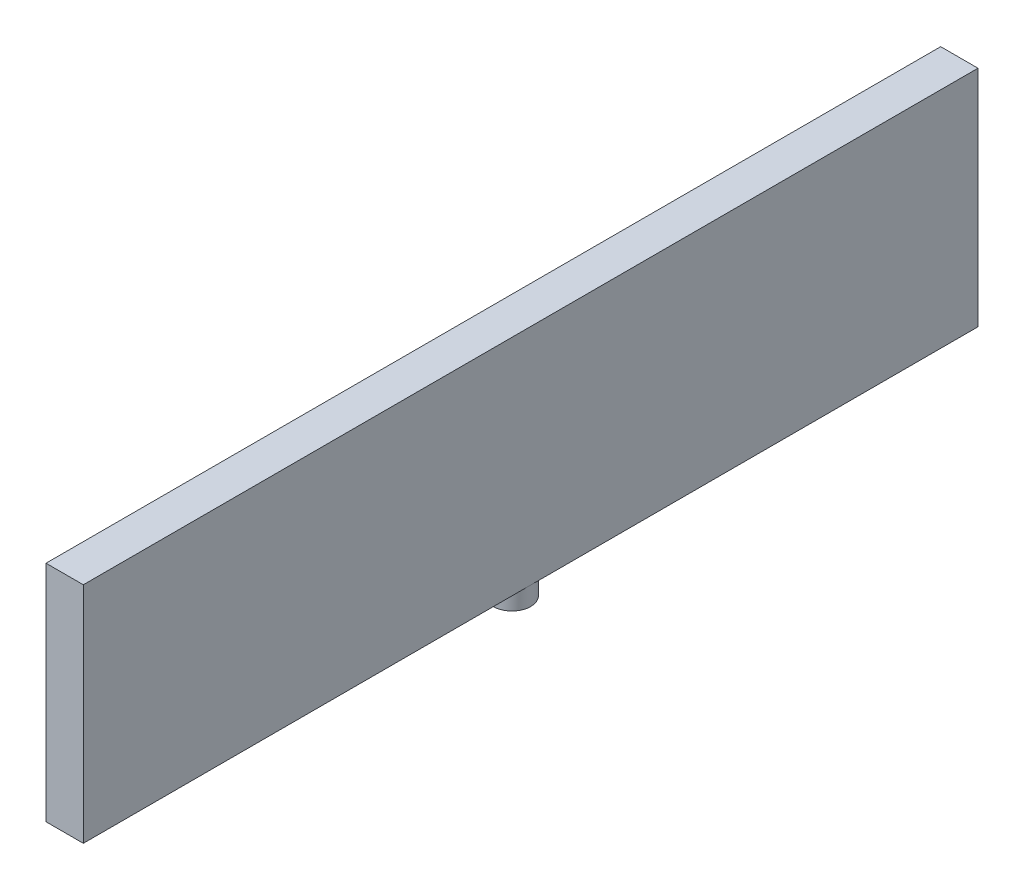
ISO-10303-21;
HEADER;
FILE_DESCRIPTION(('STEP AP214'),'2;1');
FILE_NAME('part.step','',(''),(''),'','','');
FILE_SCHEMA(('AUTOMOTIVE_DESIGN { 1 0 10303 214 1 1 1 1 }'));
ENDSEC;
DATA;
#1=APPLICATION_CONTEXT('core data for automotive mechanical design processes');
#2=APPLICATION_PROTOCOL_DEFINITION('international standard','automotive_design',2000,#1);
#3=PRODUCT_CONTEXT('',#1,'mechanical');
#4=PRODUCT('Part','Part','',(#3));
#5=PRODUCT_RELATED_PRODUCT_CATEGORY('part','',(#4));
#6=PRODUCT_DEFINITION_FORMATION('','',#4);
#7=PRODUCT_DEFINITION_CONTEXT('part definition',#1,'design');
#8=PRODUCT_DEFINITION('design','',#6,#7);
#9=PRODUCT_DEFINITION_SHAPE('','',#8);
#10=(LENGTH_UNIT() NAMED_UNIT(*) SI_UNIT(.MILLI.,.METRE.));
#11=(NAMED_UNIT(*) PLANE_ANGLE_UNIT() SI_UNIT($,.RADIAN.));
#12=(NAMED_UNIT(*) SI_UNIT($,.STERADIAN.) SOLID_ANGLE_UNIT());
#13=UNCERTAINTY_MEASURE_WITH_UNIT(LENGTH_MEASURE(1.E-05),#10,'distance_accuracy_value','');
#14=(GEOMETRIC_REPRESENTATION_CONTEXT(3) GLOBAL_UNCERTAINTY_ASSIGNED_CONTEXT((#13)) GLOBAL_UNIT_ASSIGNED_CONTEXT((#10,
#11,#12)) REPRESENTATION_CONTEXT('',''));
#15=CARTESIAN_POINT('',(0.,0.,0.));
#16=DIRECTION('',(0.,0.,1.));
#17=DIRECTION('',(1.,0.,0.));
#18=AXIS2_PLACEMENT_3D('',#15,#16,#17);
#19=CARTESIAN_POINT('',(-175.332936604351,123.187086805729,-381.677231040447));
#20=DIRECTION('',(0.,-1.,0.));
#21=DIRECTION('',(0.,0.,-1.));
#22=AXIS2_PLACEMENT_3D('',#19,#20,#21);
#23=PLANE('',#22);
#24=CARTESIAN_POINT('',(-168.982936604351,123.187086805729,-152.21307345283));
#25=DIRECTION('',(0.,-1.,0.));
#26=DIRECTION('',(0.,0.,-1.));
#27=AXIS2_PLACEMENT_3D('',#24,#25,#26);
#28=CIRCLE('',#27,6.34999999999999);
#29=CARTESIAN_POINT('',(-162.632936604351,123.187086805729,-152.21307345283));
#30=VERTEX_POINT('',#29);
#31=CARTESIAN_POINT('',(-175.332936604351,123.187086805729,-152.21307345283));
#32=VERTEX_POINT('',#31);
#33=EDGE_CURVE('E46',#30,#32,#28,.T.);
#34=ORIENTED_EDGE('',*,*,#33,.F.);
#35=DIRECTION('',(0.,0.,1.));
#36=VECTOR('',#35,1.);
#37=CARTESIAN_POINT('',(-162.632936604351,123.187086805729,-381.677231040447));
#38=LINE('',#37,#36);
#39=CARTESIAN_POINT('',(-162.632936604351,123.187086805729,0.));
#40=VERTEX_POINT('',#39);
#41=EDGE_CURVE('E87',#30,#40,#38,.T.);
#42=ORIENTED_EDGE('',*,*,#41,.T.);
#43=DIRECTION('',(1.,0.,0.));
#44=VECTOR('',#43,1.);
#45=CARTESIAN_POINT('',(-175.332936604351,123.187086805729,0.));
#46=LINE('',#45,#44);
#47=CARTESIAN_POINT('',(-175.332936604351,123.187086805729,0.));
#48=VERTEX_POINT('',#47);
#49=EDGE_CURVE('E160',#48,#40,#46,.T.);
#50=ORIENTED_EDGE('',*,*,#49,.F.);
#51=DIRECTION('',(0.,0.,1.));
#52=VECTOR('',#51,1.);
#53=CARTESIAN_POINT('',(-175.332936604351,123.187086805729,-381.677231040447));
#54=LINE('',#53,#52);
#55=EDGE_CURVE('E97',#32,#48,#54,.T.);
#56=ORIENTED_EDGE('',*,*,#55,.F.);
#57=EDGE_LOOP('',(#34,#42,#50,#56));
#58=FACE_BOUND('',#57,.T.);
#59=ADVANCED_FACE('F35',(#58),#23,.T.);
#60=CARTESIAN_POINT('',(-175.332936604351,123.187086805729,-381.677231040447));
#61=DIRECTION('',(-1.,0.,0.));
#62=DIRECTION('',(0.,0.,1.));
#63=AXIS2_PLACEMENT_3D('',#60,#61,#62);
#64=PLANE('',#63);
#65=DIRECTION('',(0.,1.,0.));
#66=VECTOR('',#65,1.);
#67=CARTESIAN_POINT('',(-175.332936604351,123.187086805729,-304.42614690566));
#68=LINE('',#67,#66);
#69=CARTESIAN_POINT('',(-175.332936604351,123.187086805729,-304.42614690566));
#70=VERTEX_POINT('',#69);
#71=CARTESIAN_POINT('',(-175.332936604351,199.387086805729,-304.42614690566));
#72=VERTEX_POINT('',#71);
#73=EDGE_CURVE('E147',#70,#72,#68,.T.);
#74=ORIENTED_EDGE('',*,*,#73,.F.);
#75=EDGE_CURVE('E39',#70,#32,#54,.T.);
#76=ORIENTED_EDGE('',*,*,#75,.T.);
#77=ORIENTED_EDGE('',*,*,#55,.T.);
#78=DIRECTION('',(0.,-1.,0.));
#79=VECTOR('',#78,1.);
#80=CARTESIAN_POINT('',(-175.332936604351,123.187086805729,0.));
#81=LINE('',#80,#79);
#82=CARTESIAN_POINT('',(-175.332936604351,199.387086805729,0.));
#83=VERTEX_POINT('',#82);
#84=EDGE_CURVE('E86',#83,#48,#81,.T.);
#85=ORIENTED_EDGE('',*,*,#84,.F.);
#86=DIRECTION('',(0.,0.,1.));
#87=VECTOR('',#86,1.);
#88=CARTESIAN_POINT('',(-175.332936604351,199.387086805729,-381.677231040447));
#89=LINE('',#88,#87);
#90=EDGE_CURVE('E143',#72,#83,#89,.T.);
#91=ORIENTED_EDGE('',*,*,#90,.F.);
#92=EDGE_LOOP('',(#74,#76,#77,#85,#91));
#93=FACE_BOUND('',#92,.T.);
#94=ADVANCED_FACE('F117',(#93),#64,.T.);
#95=CARTESIAN_POINT('',(-175.332936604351,199.387086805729,-381.677231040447));
#96=DIRECTION('',(0.,1.,0.));
#97=DIRECTION('',(0.,0.,1.));
#98=AXIS2_PLACEMENT_3D('',#95,#96,#97);
#99=PLANE('',#98);
#100=DIRECTION('',(1.,0.,0.));
#101=VECTOR('',#100,1.);
#102=CARTESIAN_POINT('',(-556.432936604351,199.387086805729,-304.42614690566));
#103=LINE('',#102,#101);
#104=CARTESIAN_POINT('',(-162.632936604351,199.387086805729,-304.42614690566));
#105=VERTEX_POINT('',#104);
#106=EDGE_CURVE('E140',#72,#105,#103,.T.);
#107=ORIENTED_EDGE('',*,*,#106,.F.);
#108=ORIENTED_EDGE('',*,*,#90,.T.);
#109=DIRECTION('',(-1.,0.,0.));
#110=VECTOR('',#109,1.);
#111=CARTESIAN_POINT('',(-175.332936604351,199.387086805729,0.));
#112=LINE('',#111,#110);
#113=CARTESIAN_POINT('',(-162.632936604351,199.387086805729,0.));
#114=VERTEX_POINT('',#113);
#115=EDGE_CURVE('E152',#114,#83,#112,.T.);
#116=ORIENTED_EDGE('',*,*,#115,.F.);
#117=DIRECTION('',(0.,0.,1.));
#118=VECTOR('',#117,1.);
#119=CARTESIAN_POINT('',(-162.632936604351,199.387086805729,-381.677231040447));
#120=LINE('',#119,#118);
#121=EDGE_CURVE('E145',#105,#114,#120,.T.);
#122=ORIENTED_EDGE('',*,*,#121,.F.);
#123=EDGE_LOOP('',(#107,#108,#116,#122));
#124=FACE_BOUND('',#123,.T.);
#125=ADVANCED_FACE('F123',(#124),#99,.T.);
#126=CARTESIAN_POINT('',(-162.632936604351,123.187086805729,-381.677231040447));
#127=DIRECTION('',(1.,0.,0.));
#128=DIRECTION('',(0.,0.,-1.));
#129=AXIS2_PLACEMENT_3D('',#126,#127,#128);
#130=PLANE('',#129);
#131=DIRECTION('',(0.,-1.,0.));
#132=VECTOR('',#131,1.);
#133=CARTESIAN_POINT('',(-162.632936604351,123.187086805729,-304.42614690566));
#134=LINE('',#133,#132);
#135=CARTESIAN_POINT('',(-162.632936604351,123.187086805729,-304.42614690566));
#136=VERTEX_POINT('',#135);
#137=EDGE_CURVE('E44',#105,#136,#134,.T.);
#138=ORIENTED_EDGE('',*,*,#137,.F.);
#139=ORIENTED_EDGE('',*,*,#121,.T.);
#140=DIRECTION('',(0.,1.,0.));
#141=VECTOR('',#140,1.);
#142=CARTESIAN_POINT('',(-162.632936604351,123.187086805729,0.));
#143=LINE('',#142,#141);
#144=EDGE_CURVE('E92',#40,#114,#143,.T.);
#145=ORIENTED_EDGE('',*,*,#144,.F.);
#146=ORIENTED_EDGE('',*,*,#41,.F.);
#147=EDGE_CURVE('E79',#136,#30,#38,.T.);
#148=ORIENTED_EDGE('',*,*,#147,.F.);
#149=EDGE_LOOP('',(#138,#139,#145,#146,#148));
#150=FACE_BOUND('',#149,.T.);
#151=ADVANCED_FACE('F90',(#150),#130,.T.);
#152=EDGE_CURVE('E11',#32,#30,#28,.T.);
#153=ORIENTED_EDGE('',*,*,#152,.F.);
#154=ORIENTED_EDGE('',*,*,#75,.F.);
#155=DIRECTION('',(1.,0.,0.));
#156=VECTOR('',#155,1.);
#157=CARTESIAN_POINT('',(-556.432936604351,123.187086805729,-304.42614690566));
#158=LINE('',#157,#156);
#159=EDGE_CURVE('E83',#70,#136,#158,.T.);
#160=ORIENTED_EDGE('',*,*,#159,.T.);
#161=ORIENTED_EDGE('',*,*,#147,.T.);
#162=EDGE_LOOP('',(#153,#154,#160,#161));
#163=FACE_BOUND('',#162,.T.);
#164=ADVANCED_FACE('F81',(#163),#23,.T.);
#165=CARTESIAN_POINT('',(-175.332936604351,199.387086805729,0.));
#166=DIRECTION('',(0.,0.,-1.));
#167=DIRECTION('',(-1.,0.,0.));
#168=AXIS2_PLACEMENT_3D('',#165,#166,#167);
#169=PLANE('',#168);
#170=ORIENTED_EDGE('',*,*,#84,.T.);
#171=ORIENTED_EDGE('',*,*,#49,.T.);
#172=ORIENTED_EDGE('',*,*,#144,.T.);
#173=ORIENTED_EDGE('',*,*,#115,.T.);
#174=EDGE_LOOP('',(#170,#171,#172,#173));
#175=FACE_BOUND('',#174,.T.);
#176=ADVANCED_FACE('F112',(#175),#169,.F.);
#177=CARTESIAN_POINT('',(-556.432936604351,199.387086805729,-304.42614690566));
#178=DIRECTION('',(0.,0.,1.));
#179=DIRECTION('',(0.,-1.,0.));
#180=AXIS2_PLACEMENT_3D('',#177,#178,#179);
#181=PLANE('',#180);
#182=ORIENTED_EDGE('',*,*,#159,.F.);
#183=ORIENTED_EDGE('',*,*,#73,.T.);
#184=ORIENTED_EDGE('',*,*,#106,.T.);
#185=ORIENTED_EDGE('',*,*,#137,.T.);
#186=EDGE_LOOP('',(#182,#183,#184,#185));
#187=FACE_BOUND('',#186,.T.);
#188=ADVANCED_FACE('F37',(#187),#181,.F.);
#189=CARTESIAN_POINT('',(-168.982936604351,116.837086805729,-152.21307345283));
#190=DIRECTION('',(0.,1.,0.));
#191=DIRECTION('',(0.,0.,1.));
#192=AXIS2_PLACEMENT_3D('',#189,#190,#191);
#193=CYLINDRICAL_SURFACE('',#192,6.34999999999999);
#194=CARTESIAN_POINT('',(-168.982936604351,116.837086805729,-152.21307345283));
#195=DIRECTION('',(0.,-1.,0.));
#196=DIRECTION('',(0.,0.,-1.));
#197=AXIS2_PLACEMENT_3D('',#194,#195,#196);
#198=CIRCLE('',#197,6.34999999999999);
#199=CARTESIAN_POINT('',(-168.982936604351,116.837086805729,-158.56307345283));
#200=VERTEX_POINT('',#199);
#201=EDGE_CURVE('E99',#200,#200,#198,.T.);
#202=ORIENTED_EDGE('',*,*,#201,.F.);
#203=EDGE_LOOP('',(#202));
#204=FACE_BOUND('',#203,.T.);
#205=ORIENTED_EDGE('',*,*,#33,.T.);
#206=ORIENTED_EDGE('',*,*,#152,.T.);
#207=EDGE_LOOP('',(#205,#206));
#208=FACE_BOUND('',#207,.T.);
#209=ADVANCED_FACE('F100',(#204,#208),#193,.T.);
#210=CARTESIAN_POINT('',(-168.982936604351,116.837086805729,-152.21307345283));
#211=DIRECTION('',(0.,-1.,0.));
#212=DIRECTION('',(0.,0.,-1.));
#213=AXIS2_PLACEMENT_3D('',#210,#211,#212);
#214=PLANE('',#213);
#215=ORIENTED_EDGE('',*,*,#201,.T.);
#216=EDGE_LOOP('',(#215));
#217=FACE_BOUND('',#216,.T.);
#218=ADVANCED_FACE('F102',(#217),#214,.T.);
#219=CLOSED_SHELL('',(#59,#94,#125,#151,#164,#176,#188,#209,#218));
#220=MANIFOLD_SOLID_BREP('B2',#219);
#221=ADVANCED_BREP_SHAPE_REPRESENTATION('',(#18,#220),#14);
#222=SHAPE_DEFINITION_REPRESENTATION(#9,#221);
ENDSEC;
END-ISO-10303-21;
